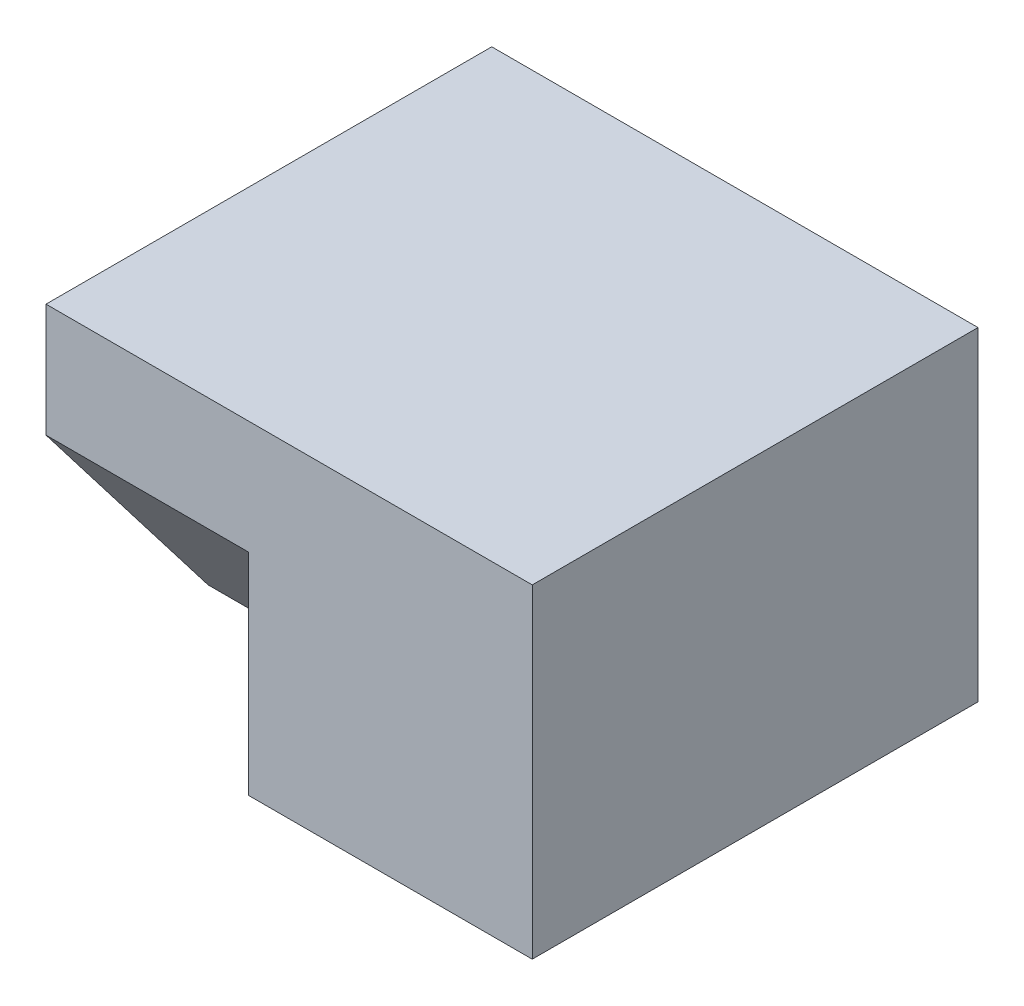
from build123d import *

# Parameters (mm, degrees)
SKETCH_1_W          = 60
SKETCH_1_H          = 40
EXTRUDE_1_DEPTH     = 55
CUT_EXTRUDE_2_DEPTH = 25


with BuildPart() as part:
    # Sketch 1 → Extrude 1 (new body)
    with BuildSketch(Plane.XY):
        with Locations((-30, 20)):
            Rectangle(SKETCH_1_W, SKETCH_1_H)
    extrude(amount=EXTRUDE_1_DEPTH)

    # Sketch 3 → Cut-Extrude 2 (cut)
    with BuildSketch(Plane.ZY.offset(60)):
        Polygon((55, 26), (55, 0), (35, 0), align=None)
    extrude(amount=-CUT_EXTRUDE_2_DEPTH, mode=Mode.SUBTRACT)


solid = part.part
